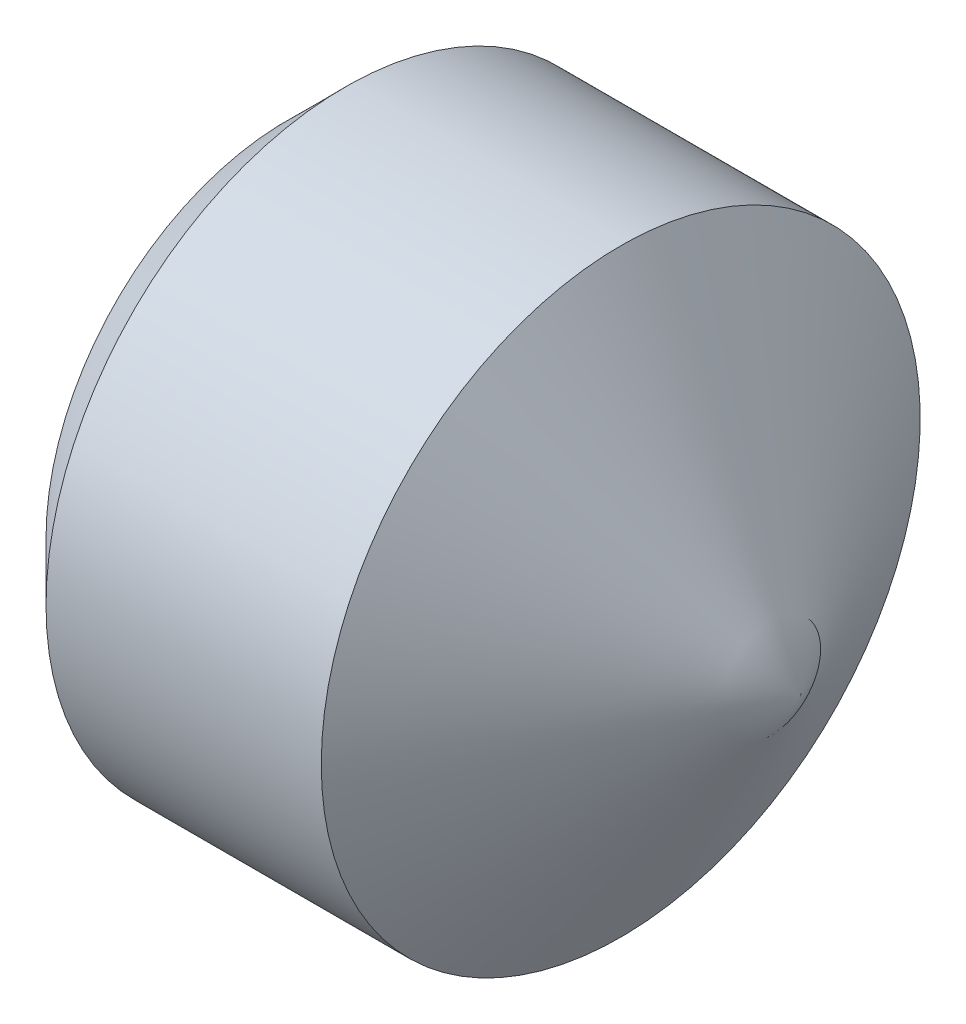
ISO-10303-21;
HEADER;
FILE_DESCRIPTION(('STEP AP214'),'2;1');
FILE_NAME('part.step','',(''),(''),'','','');
FILE_SCHEMA(('AUTOMOTIVE_DESIGN { 1 0 10303 214 1 1 1 1 }'));
ENDSEC;
DATA;
#1=APPLICATION_CONTEXT('core data for automotive mechanical design processes');
#2=APPLICATION_PROTOCOL_DEFINITION('international standard','automotive_design',2000,#1);
#3=PRODUCT_CONTEXT('',#1,'mechanical');
#4=PRODUCT('Part','Part','',(#3));
#5=PRODUCT_RELATED_PRODUCT_CATEGORY('part','',(#4));
#6=PRODUCT_DEFINITION_FORMATION('','',#4);
#7=PRODUCT_DEFINITION_CONTEXT('part definition',#1,'design');
#8=PRODUCT_DEFINITION('design','',#6,#7);
#9=PRODUCT_DEFINITION_SHAPE('','',#8);
#10=(LENGTH_UNIT() NAMED_UNIT(*) SI_UNIT(.MILLI.,.METRE.));
#11=(NAMED_UNIT(*) PLANE_ANGLE_UNIT() SI_UNIT($,.RADIAN.));
#12=(NAMED_UNIT(*) SI_UNIT($,.STERADIAN.) SOLID_ANGLE_UNIT());
#13=UNCERTAINTY_MEASURE_WITH_UNIT(LENGTH_MEASURE(1.E-05),#10,'distance_accuracy_value','');
#14=(GEOMETRIC_REPRESENTATION_CONTEXT(3) GLOBAL_UNCERTAINTY_ASSIGNED_CONTEXT((#13)) GLOBAL_UNIT_ASSIGNED_CONTEXT((#10,
#11,#12)) REPRESENTATION_CONTEXT('',''));
#15=CARTESIAN_POINT('',(0.,0.,0.));
#16=DIRECTION('',(0.,0.,1.));
#17=DIRECTION('',(1.,0.,0.));
#18=AXIS2_PLACEMENT_3D('',#15,#16,#17);
#19=CARTESIAN_POINT('',(0.,0.,0.));
#20=DIRECTION('',(-1.,0.,0.));
#21=DIRECTION('',(0.,0.,1.));
#22=AXIS2_PLACEMENT_3D('',#19,#20,#21);
#23=PLANE('',#22);
#24=CARTESIAN_POINT('',(0.,0.,0.));
#25=DIRECTION('',(-1.,0.,0.));
#26=DIRECTION('',(0.,0.,1.));
#27=AXIS2_PLACEMENT_3D('',#24,#25,#26);
#28=CIRCLE('',#27,4.47675);
#29=CARTESIAN_POINT('',(0.,0.,4.47675));
#30=VERTEX_POINT('',#29);
#31=EDGE_CURVE('E11',#30,#30,#28,.T.);
#32=ORIENTED_EDGE('',*,*,#31,.T.);
#33=EDGE_LOOP('',(#32));
#34=FACE_BOUND('',#33,.T.);
#35=DIRECTION('',(0.,0.,-1.));
#36=VECTOR('',#35,1.);
#37=CARTESIAN_POINT('',(0.,2.77749,1.60358459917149));
#38=LINE('',#37,#36);
#39=CARTESIAN_POINT('',(0.,2.77749,1.60358459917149));
#40=VERTEX_POINT('',#39);
#41=CARTESIAN_POINT('',(0.,2.77749,-1.60358459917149));
#42=VERTEX_POINT('',#41);
#43=EDGE_CURVE('E92',#40,#42,#38,.T.);
#44=ORIENTED_EDGE('',*,*,#43,.F.);
#45=DIRECTION('',(0.,-0.866025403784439,0.5));
#46=VECTOR('',#45,1.);
#47=CARTESIAN_POINT('',(0.,2.77749,1.60358459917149));
#48=LINE('',#47,#46);
#49=CARTESIAN_POINT('',(0.,0.,3.20716919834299));
#50=VERTEX_POINT('',#49);
#51=EDGE_CURVE('E45',#40,#50,#48,.T.);
#52=ORIENTED_EDGE('',*,*,#51,.T.);
#53=DIRECTION('',(0.,0.866025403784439,0.5));
#54=VECTOR('',#53,1.);
#55=CARTESIAN_POINT('',(0.,-2.77749,1.60358459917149));
#56=LINE('',#55,#54);
#57=CARTESIAN_POINT('',(0.,-2.77749,1.60358459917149));
#58=VERTEX_POINT('',#57);
#59=EDGE_CURVE('E98',#58,#50,#56,.T.);
#60=ORIENTED_EDGE('',*,*,#59,.F.);
#61=DIRECTION('',(0.,0.,-1.));
#62=VECTOR('',#61,1.);
#63=CARTESIAN_POINT('',(0.,-2.77749,1.60358459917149));
#64=LINE('',#63,#62);
#65=CARTESIAN_POINT('',(0.,-2.77749,-1.60358459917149));
#66=VERTEX_POINT('',#65);
#67=EDGE_CURVE('E118',#58,#66,#64,.T.);
#68=ORIENTED_EDGE('',*,*,#67,.T.);
#69=DIRECTION('',(0.,0.866025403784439,-0.5));
#70=VECTOR('',#69,1.);
#71=CARTESIAN_POINT('',(0.,-2.77749,-1.60358459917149));
#72=LINE('',#71,#70);
#73=CARTESIAN_POINT('',(0.,0.,-3.20716919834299));
#74=VERTEX_POINT('',#73);
#75=EDGE_CURVE('E121',#66,#74,#72,.T.);
#76=ORIENTED_EDGE('',*,*,#75,.T.);
#77=DIRECTION('',(0.,-0.866025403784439,-0.5));
#78=VECTOR('',#77,1.);
#79=CARTESIAN_POINT('',(0.,2.77749,-1.60358459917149));
#80=LINE('',#79,#78);
#81=EDGE_CURVE('E124',#42,#74,#80,.T.);
#82=ORIENTED_EDGE('',*,*,#81,.F.);
#83=EDGE_LOOP('',(#44,#52,#60,#68,#76,#82));
#84=FACE_BOUND('',#83,.T.);
#85=ADVANCED_FACE('F31',(#34,#84),#23,.T.);
#86=CARTESIAN_POINT('',(0.,0.,0.));
#87=DIRECTION('',(1.,0.,0.));
#88=DIRECTION('',(0.,0.,-1.));
#89=AXIS2_PLACEMENT_3D('',#86,#87,#88);
#90=CONICAL_SURFACE('',#89,4.47675,0.785398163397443);
#91=CARTESIAN_POINT('',(1.07950000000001,0.,0.));
#92=DIRECTION('',(-1.,0.,0.));
#93=DIRECTION('',(0.,0.,1.));
#94=AXIS2_PLACEMENT_3D('',#91,#92,#93);
#95=CIRCLE('',#94,5.55625);
#96=CARTESIAN_POINT('',(1.07950000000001,0.,5.55625));
#97=VERTEX_POINT('',#96);
#98=EDGE_CURVE('E38',#97,#97,#95,.T.);
#99=ORIENTED_EDGE('',*,*,#98,.T.);
#100=EDGE_LOOP('',(#99));
#101=FACE_BOUND('',#100,.T.);
#102=ORIENTED_EDGE('',*,*,#31,.F.);
#103=EDGE_LOOP('',(#102));
#104=FACE_BOUND('',#103,.T.);
#105=ADVANCED_FACE('F141',(#101,#104),#90,.T.);
#106=CARTESIAN_POINT('',(-12.7,0.,0.));
#107=DIRECTION('',(-1.,0.,0.));
#108=DIRECTION('',(0.,0.,1.));
#109=AXIS2_PLACEMENT_3D('',#106,#107,#108);
#110=CYLINDRICAL_SURFACE('',#109,5.55625);
#111=CARTESIAN_POINT('',(6.18646818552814,0.,0.));
#112=DIRECTION('',(-1.,0.,0.));
#113=DIRECTION('',(0.,0.,1.));
#114=AXIS2_PLACEMENT_3D('',#111,#112,#113);
#115=CIRCLE('',#114,5.55625);
#116=CARTESIAN_POINT('',(6.18646818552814,0.,5.55625));
#117=VERTEX_POINT('',#116);
#118=EDGE_CURVE('E99',#117,#117,#115,.T.);
#119=ORIENTED_EDGE('',*,*,#118,.T.);
#120=EDGE_LOOP('',(#119));
#121=FACE_BOUND('',#120,.T.);
#122=ORIENTED_EDGE('',*,*,#98,.F.);
#123=EDGE_LOOP('',(#122));
#124=FACE_BOUND('',#123,.T.);
#125=ADVANCED_FACE('F144',(#121,#124),#110,.T.);
#126=CARTESIAN_POINT('',(6.18646818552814,0.,0.));
#127=DIRECTION('',(-1.,0.,0.));
#128=DIRECTION('',(0.,0.,1.));
#129=AXIS2_PLACEMENT_3D('',#126,#127,#128);
#130=CONICAL_SURFACE('',#129,5.55625,1.02974425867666);
#131=CARTESIAN_POINT('',(9.525,0.,0.));
#132=VERTEX_POINT('',#131);
#133=VERTEX_LOOP('',#132);
#134=FACE_BOUND('',#133,.T.);
#135=ORIENTED_EDGE('',*,*,#118,.F.);
#136=EDGE_LOOP('',(#135));
#137=FACE_BOUND('',#136,.T.);
#138=ADVANCED_FACE('F146',(#134,#137),#130,.T.);
#139=CARTESIAN_POINT('',(5.5626,2.77749,1.60358459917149));
#140=DIRECTION('',(0.,-0.5,-0.866025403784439));
#141=DIRECTION('',(0.,0.866025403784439,-0.5));
#142=AXIS2_PLACEMENT_3D('',#139,#140,#141);
#143=PLANE('',#142);
#144=ORIENTED_EDGE('',*,*,#51,.F.);
#145=DIRECTION('',(-1.,0.,0.));
#146=VECTOR('',#145,1.);
#147=CARTESIAN_POINT('',(5.5626,2.77749,1.60358459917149));
#148=LINE('',#147,#146);
#149=CARTESIAN_POINT('',(5.5626,2.77749,1.60358459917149));
#150=VERTEX_POINT('',#149);
#151=EDGE_CURVE('E86',#150,#40,#148,.T.);
#152=ORIENTED_EDGE('',*,*,#151,.F.);
#153=DIRECTION('',(0.,-0.866025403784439,0.5));
#154=VECTOR('',#153,1.);
#155=CARTESIAN_POINT('',(5.5626,2.77749,1.60358459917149));
#156=LINE('',#155,#154);
#157=CARTESIAN_POINT('',(5.5626,0.,3.20716919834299));
#158=VERTEX_POINT('',#157);
#159=EDGE_CURVE('E81',#150,#158,#156,.T.);
#160=ORIENTED_EDGE('',*,*,#159,.T.);
#161=DIRECTION('',(-1.,0.,0.));
#162=VECTOR('',#161,1.);
#163=CARTESIAN_POINT('',(5.5626,0.,3.20716919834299));
#164=LINE('',#163,#162);
#165=EDGE_CURVE('E84',#158,#50,#164,.T.);
#166=ORIENTED_EDGE('',*,*,#165,.T.);
#167=EDGE_LOOP('',(#144,#152,#160,#166));
#168=FACE_BOUND('',#167,.T.);
#169=ADVANCED_FACE('F83',(#168),#143,.T.);
#170=CARTESIAN_POINT('',(5.5626,-2.77749,1.60358459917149));
#171=DIRECTION('',(0.,-0.5,0.866025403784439));
#172=DIRECTION('',(0.,-0.866025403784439,-0.5));
#173=AXIS2_PLACEMENT_3D('',#170,#171,#172);
#174=PLANE('',#173);
#175=ORIENTED_EDGE('',*,*,#59,.T.);
#176=ORIENTED_EDGE('',*,*,#165,.F.);
#177=DIRECTION('',(0.,0.866025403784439,0.5));
#178=VECTOR('',#177,1.);
#179=CARTESIAN_POINT('',(5.5626,-2.77749,1.60358459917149));
#180=LINE('',#179,#178);
#181=CARTESIAN_POINT('',(5.5626,-2.77749,1.60358459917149));
#182=VERTEX_POINT('',#181);
#183=EDGE_CURVE('E91',#182,#158,#180,.T.);
#184=ORIENTED_EDGE('',*,*,#183,.F.);
#185=DIRECTION('',(-1.,0.,0.));
#186=VECTOR('',#185,1.);
#187=CARTESIAN_POINT('',(5.5626,-2.77749,1.60358459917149));
#188=LINE('',#187,#186);
#189=EDGE_CURVE('E100',#182,#58,#188,.T.);
#190=ORIENTED_EDGE('',*,*,#189,.T.);
#191=EDGE_LOOP('',(#175,#176,#184,#190));
#192=FACE_BOUND('',#191,.T.);
#193=ADVANCED_FACE('F96',(#192),#174,.F.);
#194=CARTESIAN_POINT('',(5.5626,-2.77749,1.60358459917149));
#195=DIRECTION('',(0.,1.,0.));
#196=DIRECTION('',(0.,0.,1.));
#197=AXIS2_PLACEMENT_3D('',#194,#195,#196);
#198=PLANE('',#197);
#199=ORIENTED_EDGE('',*,*,#67,.F.);
#200=ORIENTED_EDGE('',*,*,#189,.F.);
#201=DIRECTION('',(0.,0.,-1.));
#202=VECTOR('',#201,1.);
#203=CARTESIAN_POINT('',(5.5626,-2.77749,1.60358459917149));
#204=LINE('',#203,#202);
#205=CARTESIAN_POINT('',(5.5626,-2.77749,-1.60358459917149));
#206=VERTEX_POINT('',#205);
#207=EDGE_CURVE('E105',#182,#206,#204,.T.);
#208=ORIENTED_EDGE('',*,*,#207,.T.);
#209=DIRECTION('',(-1.,0.,0.));
#210=VECTOR('',#209,1.);
#211=CARTESIAN_POINT('',(5.5626,-2.77749,-1.60358459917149));
#212=LINE('',#211,#210);
#213=EDGE_CURVE('E134',#206,#66,#212,.T.);
#214=ORIENTED_EDGE('',*,*,#213,.T.);
#215=EDGE_LOOP('',(#199,#200,#208,#214));
#216=FACE_BOUND('',#215,.T.);
#217=ADVANCED_FACE('F174',(#216),#198,.T.);
#218=CARTESIAN_POINT('',(5.5626,-2.77749,-1.60358459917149));
#219=DIRECTION('',(0.,0.5,0.866025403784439));
#220=DIRECTION('',(0.,-0.866025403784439,0.5));
#221=AXIS2_PLACEMENT_3D('',#218,#219,#220);
#222=PLANE('',#221);
#223=ORIENTED_EDGE('',*,*,#75,.F.);
#224=ORIENTED_EDGE('',*,*,#213,.F.);
#225=DIRECTION('',(0.,0.866025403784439,-0.5));
#226=VECTOR('',#225,1.);
#227=CARTESIAN_POINT('',(5.5626,-2.77749,-1.60358459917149));
#228=LINE('',#227,#226);
#229=CARTESIAN_POINT('',(5.5626,0.,-3.20716919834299));
#230=VERTEX_POINT('',#229);
#231=EDGE_CURVE('E107',#206,#230,#228,.T.);
#232=ORIENTED_EDGE('',*,*,#231,.T.);
#233=DIRECTION('',(-1.,0.,0.));
#234=VECTOR('',#233,1.);
#235=CARTESIAN_POINT('',(5.5626,0.,-3.20716919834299));
#236=LINE('',#235,#234);
#237=EDGE_CURVE('E132',#230,#74,#236,.T.);
#238=ORIENTED_EDGE('',*,*,#237,.T.);
#239=EDGE_LOOP('',(#223,#224,#232,#238));
#240=FACE_BOUND('',#239,.T.);
#241=ADVANCED_FACE('F170',(#240),#222,.T.);
#242=CARTESIAN_POINT('',(5.5626,2.77749,-1.60358459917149));
#243=DIRECTION('',(0.,0.5,-0.866025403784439));
#244=DIRECTION('',(0.,0.866025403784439,0.5));
#245=AXIS2_PLACEMENT_3D('',#242,#243,#244);
#246=PLANE('',#245);
#247=ORIENTED_EDGE('',*,*,#81,.T.);
#248=ORIENTED_EDGE('',*,*,#237,.F.);
#249=DIRECTION('',(0.,-0.866025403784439,-0.5));
#250=VECTOR('',#249,1.);
#251=CARTESIAN_POINT('',(5.5626,2.77749,-1.60358459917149));
#252=LINE('',#251,#250);
#253=CARTESIAN_POINT('',(5.5626,2.77749,-1.60358459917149));
#254=VERTEX_POINT('',#253);
#255=EDGE_CURVE('E111',#254,#230,#252,.T.);
#256=ORIENTED_EDGE('',*,*,#255,.F.);
#257=DIRECTION('',(-1.,0.,0.));
#258=VECTOR('',#257,1.);
#259=CARTESIAN_POINT('',(5.5626,2.77749,-1.60358459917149));
#260=LINE('',#259,#258);
#261=EDGE_CURVE('E130',#254,#42,#260,.T.);
#262=ORIENTED_EDGE('',*,*,#261,.T.);
#263=EDGE_LOOP('',(#247,#248,#256,#262));
#264=FACE_BOUND('',#263,.T.);
#265=ADVANCED_FACE('F167',(#264),#246,.F.);
#266=CARTESIAN_POINT('',(5.5626,2.77749,1.60358459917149));
#267=DIRECTION('',(0.,1.,0.));
#268=DIRECTION('',(0.,0.,1.));
#269=AXIS2_PLACEMENT_3D('',#266,#267,#268);
#270=PLANE('',#269);
#271=ORIENTED_EDGE('',*,*,#43,.T.);
#272=ORIENTED_EDGE('',*,*,#261,.F.);
#273=DIRECTION('',(0.,0.,-1.));
#274=VECTOR('',#273,1.);
#275=CARTESIAN_POINT('',(5.5626,2.77749,1.60358459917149));
#276=LINE('',#275,#274);
#277=EDGE_CURVE('E114',#150,#254,#276,.T.);
#278=ORIENTED_EDGE('',*,*,#277,.F.);
#279=ORIENTED_EDGE('',*,*,#151,.T.);
#280=EDGE_LOOP('',(#271,#272,#278,#279));
#281=FACE_BOUND('',#280,.T.);
#282=ADVANCED_FACE('F163',(#281),#270,.F.);
#283=CARTESIAN_POINT('',(5.5626,2.77749,1.60358459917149));
#284=DIRECTION('',(1.,0.,0.));
#285=DIRECTION('',(0.,0.,-1.));
#286=AXIS2_PLACEMENT_3D('',#283,#284,#285);
#287=PLANE('',#286);
#288=ORIENTED_EDGE('',*,*,#159,.F.);
#289=ORIENTED_EDGE('',*,*,#277,.T.);
#290=ORIENTED_EDGE('',*,*,#255,.T.);
#291=ORIENTED_EDGE('',*,*,#231,.F.);
#292=ORIENTED_EDGE('',*,*,#207,.F.);
#293=ORIENTED_EDGE('',*,*,#183,.T.);
#294=EDGE_LOOP('',(#288,#289,#290,#291,#292,#293));
#295=FACE_BOUND('',#294,.T.);
#296=ADVANCED_FACE('F103',(#295),#287,.F.);
#297=CLOSED_SHELL('',(#85,#105,#125,#138,#169,#193,#217,#241,#265,#282,#296));
#298=MANIFOLD_SOLID_BREP('B2',#297);
#299=ADVANCED_BREP_SHAPE_REPRESENTATION('',(#18,#298),#14);
#300=SHAPE_DEFINITION_REPRESENTATION(#9,#299);
ENDSEC;
END-ISO-10303-21;
